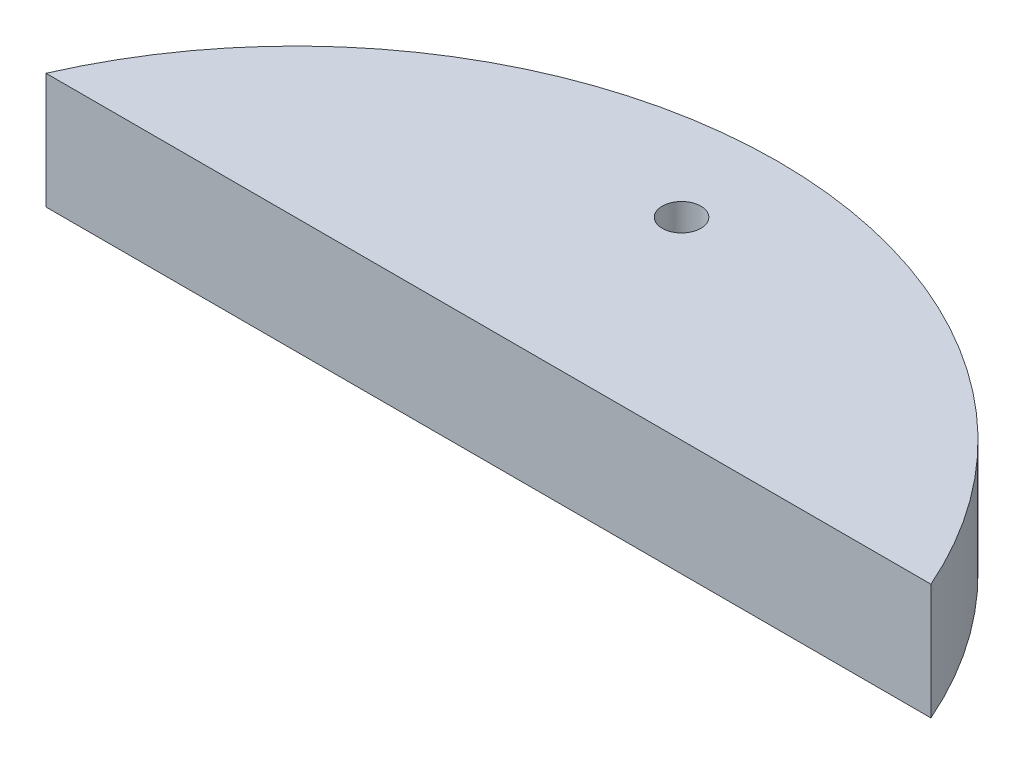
ISO-10303-21;
HEADER;
FILE_DESCRIPTION(('STEP AP214'),'2;1');
FILE_NAME('part.step','',(''),(''),'','','');
FILE_SCHEMA(('AUTOMOTIVE_DESIGN { 1 0 10303 214 1 1 1 1 }'));
ENDSEC;
DATA;
#1=APPLICATION_CONTEXT('core data for automotive mechanical design processes');
#2=APPLICATION_PROTOCOL_DEFINITION('international standard','automotive_design',2000,#1);
#3=PRODUCT_CONTEXT('',#1,'mechanical');
#4=PRODUCT('Part','Part','',(#3));
#5=PRODUCT_RELATED_PRODUCT_CATEGORY('part','',(#4));
#6=PRODUCT_DEFINITION_FORMATION('','',#4);
#7=PRODUCT_DEFINITION_CONTEXT('part definition',#1,'design');
#8=PRODUCT_DEFINITION('design','',#6,#7);
#9=PRODUCT_DEFINITION_SHAPE('','',#8);
#10=(LENGTH_UNIT() NAMED_UNIT(*) SI_UNIT(.MILLI.,.METRE.));
#11=(NAMED_UNIT(*) PLANE_ANGLE_UNIT() SI_UNIT($,.RADIAN.));
#12=(NAMED_UNIT(*) SI_UNIT($,.STERADIAN.) SOLID_ANGLE_UNIT());
#13=UNCERTAINTY_MEASURE_WITH_UNIT(LENGTH_MEASURE(1.E-05),#10,'distance_accuracy_value','');
#14=(GEOMETRIC_REPRESENTATION_CONTEXT(3) GLOBAL_UNCERTAINTY_ASSIGNED_CONTEXT((#13)) GLOBAL_UNIT_ASSIGNED_CONTEXT((#10,
#11,#12)) REPRESENTATION_CONTEXT('',''));
#15=CARTESIAN_POINT('',(0.,0.,0.));
#16=DIRECTION('',(0.,0.,1.));
#17=DIRECTION('',(1.,0.,0.));
#18=AXIS2_PLACEMENT_3D('',#15,#16,#17);
#19=CARTESIAN_POINT('',(0.,3.,0.));
#20=DIRECTION('',(0.,1.,0.));
#21=DIRECTION('',(0.,0.,1.));
#22=AXIS2_PLACEMENT_3D('',#19,#20,#21);
#23=PLANE('',#22);
#24=CARTESIAN_POINT('',(0.,3.,-10.));
#25=DIRECTION('',(0.,1.,0.));
#26=DIRECTION('',(0.,0.,1.));
#27=AXIS2_PLACEMENT_3D('',#24,#25,#26);
#28=CIRCLE('',#27,0.5);
#29=CARTESIAN_POINT('',(0.,3.,-9.5));
#30=VERTEX_POINT('',#29);
#31=EDGE_CURVE('E68',#30,#30,#28,.T.);
#32=ORIENTED_EDGE('',*,*,#31,.F.);
#33=EDGE_LOOP('',(#32));
#34=FACE_BOUND('',#33,.T.);
#35=CARTESIAN_POINT('',(0.,3.,0.));
#36=DIRECTION('',(0.,1.,0.));
#37=DIRECTION('',(0.,0.,1.));
#38=AXIS2_PLACEMENT_3D('',#35,#36,#37);
#39=CIRCLE('',#38,12.5);
#40=CARTESIAN_POINT('',(11.4564392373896,3.,-5.));
#41=VERTEX_POINT('',#40);
#42=CARTESIAN_POINT('',(-11.4564392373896,3.,-5.));
#43=VERTEX_POINT('',#42);
#44=EDGE_CURVE('E67',#41,#43,#39,.T.);
#45=ORIENTED_EDGE('',*,*,#44,.T.);
#46=DIRECTION('',(1.,0.,0.));
#47=VECTOR('',#46,1.);
#48=CARTESIAN_POINT('',(0.,3.,-5.));
#49=LINE('',#48,#47);
#50=EDGE_CURVE('E52',#43,#41,#49,.T.);
#51=ORIENTED_EDGE('',*,*,#50,.T.);
#52=EDGE_LOOP('',(#45,#51));
#53=FACE_BOUND('',#52,.T.);
#54=ADVANCED_FACE('F33',(#34,#53),#23,.T.);
#55=CARTESIAN_POINT('',(0.,0.,0.));
#56=DIRECTION('',(0.,1.,0.));
#57=DIRECTION('',(0.,0.,1.));
#58=AXIS2_PLACEMENT_3D('',#55,#56,#57);
#59=PLANE('',#58);
#60=CARTESIAN_POINT('',(0.,0.,-10.));
#61=DIRECTION('',(0.,1.,0.));
#62=DIRECTION('',(0.,0.,1.));
#63=AXIS2_PLACEMENT_3D('',#60,#61,#62);
#64=CIRCLE('',#63,0.5);
#65=CARTESIAN_POINT('',(0.,0.,-9.5));
#66=VERTEX_POINT('',#65);
#67=EDGE_CURVE('E72',#66,#66,#64,.T.);
#68=ORIENTED_EDGE('',*,*,#67,.T.);
#69=EDGE_LOOP('',(#68));
#70=FACE_BOUND('',#69,.T.);
#71=DIRECTION('',(-1.,0.,0.));
#72=VECTOR('',#71,1.);
#73=CARTESIAN_POINT('',(-12.5,0.,-5.));
#74=LINE('',#73,#72);
#75=CARTESIAN_POINT('',(11.4564392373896,0.,-5.));
#76=VERTEX_POINT('',#75);
#77=CARTESIAN_POINT('',(-11.4564392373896,0.,-5.));
#78=VERTEX_POINT('',#77);
#79=EDGE_CURVE('E47',#76,#78,#74,.T.);
#80=ORIENTED_EDGE('',*,*,#79,.T.);
#81=CARTESIAN_POINT('',(0.,0.,0.));
#82=DIRECTION('',(0.,1.,0.));
#83=DIRECTION('',(0.,0.,1.));
#84=AXIS2_PLACEMENT_3D('',#81,#82,#83);
#85=CIRCLE('',#84,12.5);
#86=EDGE_CURVE('E65',#76,#78,#85,.T.);
#87=ORIENTED_EDGE('',*,*,#86,.F.);
#88=EDGE_LOOP('',(#80,#87));
#89=FACE_BOUND('',#88,.T.);
#90=ADVANCED_FACE('F64',(#70,#89),#59,.F.);
#91=CARTESIAN_POINT('',(0.,3.,0.));
#92=DIRECTION('',(0.,-1.,0.));
#93=DIRECTION('',(0.,0.,-1.));
#94=AXIS2_PLACEMENT_3D('',#91,#92,#93);
#95=CYLINDRICAL_SURFACE('',#94,12.5);
#96=DIRECTION('',(0.,-1.,0.));
#97=VECTOR('',#96,1.);
#98=CARTESIAN_POINT('',(-11.4564392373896,3.,-5.));
#99=LINE('',#98,#97);
#100=EDGE_CURVE('E11',#43,#78,#99,.T.);
#101=ORIENTED_EDGE('',*,*,#100,.F.);
#102=ORIENTED_EDGE('',*,*,#44,.F.);
#103=DIRECTION('',(0.,-1.,0.));
#104=VECTOR('',#103,1.);
#105=CARTESIAN_POINT('',(11.4564392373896,3.,-5.));
#106=LINE('',#105,#104);
#107=EDGE_CURVE('E41',#76,#41,#106,.F.);
#108=ORIENTED_EDGE('',*,*,#107,.F.);
#109=ORIENTED_EDGE('',*,*,#86,.T.);
#110=EDGE_LOOP('',(#101,#102,#108,#109));
#111=FACE_BOUND('',#110,.T.);
#112=ADVANCED_FACE('F35',(#111),#95,.T.);
#113=CARTESIAN_POINT('',(0.,3.,-10.));
#114=DIRECTION('',(0.,-1.,0.));
#115=DIRECTION('',(0.,0.,-1.));
#116=AXIS2_PLACEMENT_3D('',#113,#114,#115);
#117=CYLINDRICAL_SURFACE('',#116,0.5);
#118=ORIENTED_EDGE('',*,*,#31,.T.);
#119=EDGE_LOOP('',(#118));
#120=FACE_BOUND('',#119,.T.);
#121=ORIENTED_EDGE('',*,*,#67,.F.);
#122=EDGE_LOOP('',(#121));
#123=FACE_BOUND('',#122,.T.);
#124=ADVANCED_FACE('F81',(#120,#123),#117,.F.);
#125=CARTESIAN_POINT('',(-12.5,10.,-5.));
#126=DIRECTION('',(0.,0.,1.));
#127=DIRECTION('',(1.,0.,0.));
#128=AXIS2_PLACEMENT_3D('',#125,#126,#127);
#129=PLANE('',#128);
#130=ORIENTED_EDGE('',*,*,#100,.T.);
#131=ORIENTED_EDGE('',*,*,#79,.F.);
#132=ORIENTED_EDGE('',*,*,#107,.T.);
#133=ORIENTED_EDGE('',*,*,#50,.F.);
#134=EDGE_LOOP('',(#130,#131,#132,#133));
#135=FACE_BOUND('',#134,.T.);
#136=ADVANCED_FACE('F57',(#135),#129,.T.);
#137=CLOSED_SHELL('',(#54,#90,#112,#124,#136));
#138=MANIFOLD_SOLID_BREP('B2',#137);
#139=ADVANCED_BREP_SHAPE_REPRESENTATION('',(#18,#138),#14);
#140=SHAPE_DEFINITION_REPRESENTATION(#9,#139);
ENDSEC;
END-ISO-10303-21;
